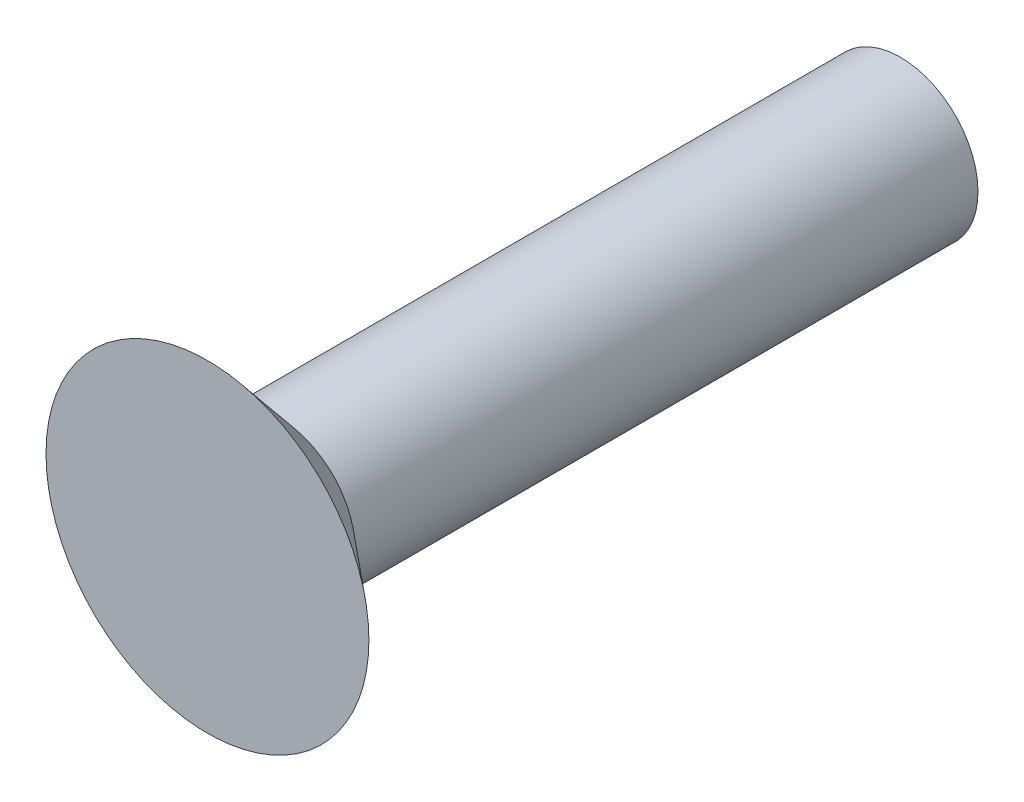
ISO-10303-21;
HEADER;
FILE_DESCRIPTION(('STEP AP214'),'2;1');
FILE_NAME('part.step','',(''),(''),'','','');
FILE_SCHEMA(('AUTOMOTIVE_DESIGN { 1 0 10303 214 1 1 1 1 }'));
ENDSEC;
DATA;
#1=APPLICATION_CONTEXT('core data for automotive mechanical design processes');
#2=APPLICATION_PROTOCOL_DEFINITION('international standard','automotive_design',2000,#1);
#3=PRODUCT_CONTEXT('',#1,'mechanical');
#4=PRODUCT('Part','Part','',(#3));
#5=PRODUCT_RELATED_PRODUCT_CATEGORY('part','',(#4));
#6=PRODUCT_DEFINITION_FORMATION('','',#4);
#7=PRODUCT_DEFINITION_CONTEXT('part definition',#1,'design');
#8=PRODUCT_DEFINITION('design','',#6,#7);
#9=PRODUCT_DEFINITION_SHAPE('','',#8);
#10=(LENGTH_UNIT() NAMED_UNIT(*) SI_UNIT(.MILLI.,.METRE.));
#11=(NAMED_UNIT(*) PLANE_ANGLE_UNIT() SI_UNIT($,.RADIAN.));
#12=(NAMED_UNIT(*) SI_UNIT($,.STERADIAN.) SOLID_ANGLE_UNIT());
#13=UNCERTAINTY_MEASURE_WITH_UNIT(LENGTH_MEASURE(1.E-05),#10,'distance_accuracy_value','');
#14=(GEOMETRIC_REPRESENTATION_CONTEXT(3) GLOBAL_UNCERTAINTY_ASSIGNED_CONTEXT((#13)) GLOBAL_UNIT_ASSIGNED_CONTEXT((#10,
#11,#12)) REPRESENTATION_CONTEXT('',''));
#15=CARTESIAN_POINT('',(0.,0.,0.));
#16=DIRECTION('',(0.,0.,1.));
#17=DIRECTION('',(1.,0.,0.));
#18=AXIS2_PLACEMENT_3D('',#15,#16,#17);
#19=CARTESIAN_POINT('',(0.,0.,-6.35));
#20=DIRECTION('',(0.,0.,1.));
#21=DIRECTION('',(1.,0.,0.));
#22=AXIS2_PLACEMENT_3D('',#19,#20,#21);
#23=CYLINDRICAL_SURFACE('',#22,0.7112);
#24=CARTESIAN_POINT('',(0.,0.,-0.64472220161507));
#25=DIRECTION('',(0.,0.,1.));
#26=DIRECTION('',(1.,0.,0.));
#27=AXIS2_PLACEMENT_3D('',#24,#25,#26);
#28=CIRCLE('',#27,0.7112);
#29=CARTESIAN_POINT('',(0.7112,0.,-0.644722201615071));
#30=VERTEX_POINT('',#29);
#31=EDGE_CURVE('E10',#30,#30,#28,.T.);
#32=ORIENTED_EDGE('',*,*,#31,.F.);
#33=EDGE_LOOP('',(#32));
#34=FACE_BOUND('',#33,.T.);
#35=CARTESIAN_POINT('',(0.,0.,-6.35));
#36=DIRECTION('',(0.,0.,1.));
#37=DIRECTION('',(1.,0.,0.));
#38=AXIS2_PLACEMENT_3D('',#35,#36,#37);
#39=CIRCLE('',#38,0.7112);
#40=CARTESIAN_POINT('',(0.7112,0.,-6.35));
#41=VERTEX_POINT('',#40);
#42=EDGE_CURVE('E37',#41,#41,#39,.T.);
#43=ORIENTED_EDGE('',*,*,#42,.T.);
#44=EDGE_LOOP('',(#43));
#45=FACE_BOUND('',#44,.T.);
#46=ADVANCED_FACE('F31',(#34,#45),#23,.T.);
#47=CARTESIAN_POINT('',(0.,0.,-6.35));
#48=DIRECTION('',(0.,0.,1.));
#49=DIRECTION('',(1.,0.,0.));
#50=AXIS2_PLACEMENT_3D('',#47,#48,#49);
#51=PLANE('',#50);
#52=ORIENTED_EDGE('',*,*,#42,.F.);
#53=EDGE_LOOP('',(#52));
#54=FACE_BOUND('',#53,.T.);
#55=ADVANCED_FACE('F55',(#54),#51,.F.);
#56=CARTESIAN_POINT('',(0.,0.,-1.24148985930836));
#57=DIRECTION('',(0.,0.,1.));
#58=DIRECTION('',(1.,0.,0.));
#59=AXIS2_PLACEMENT_3D('',#56,#57,#58);
#60=CONICAL_SURFACE('',#59,0.,0.872664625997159);
#61=ORIENTED_EDGE('',*,*,#31,.T.);
#62=EDGE_LOOP('',(#61));
#63=FACE_BOUND('',#62,.T.);
#64=CARTESIAN_POINT('',(0.,0.,0.));
#65=DIRECTION('',(0.,0.,-1.));
#66=DIRECTION('',(-1.,0.,0.));
#67=AXIS2_PLACEMENT_3D('',#64,#65,#66);
#68=CIRCLE('',#67,1.47955);
#69=CARTESIAN_POINT('',(-1.47955,0.,0.));
#70=VERTEX_POINT('',#69);
#71=EDGE_CURVE('E41',#70,#70,#68,.T.);
#72=ORIENTED_EDGE('',*,*,#71,.T.);
#73=EDGE_LOOP('',(#72));
#74=FACE_BOUND('',#73,.T.);
#75=ADVANCED_FACE('F48',(#63,#74),#60,.T.);
#76=CARTESIAN_POINT('',(0.,0.,0.));
#77=DIRECTION('',(0.,0.,1.));
#78=DIRECTION('',(1.,0.,0.));
#79=AXIS2_PLACEMENT_3D('',#76,#77,#78);
#80=PLANE('',#79);
#81=ORIENTED_EDGE('',*,*,#71,.F.);
#82=EDGE_LOOP('',(#81));
#83=FACE_BOUND('',#82,.T.);
#84=ADVANCED_FACE('F50',(#83),#80,.T.);
#85=CLOSED_SHELL('',(#46,#55,#75,#84));
#86=MANIFOLD_SOLID_BREP('B2',#85);
#87=ADVANCED_BREP_SHAPE_REPRESENTATION('',(#18,#86),#14);
#88=SHAPE_DEFINITION_REPRESENTATION(#9,#87);
ENDSEC;
END-ISO-10303-21;
